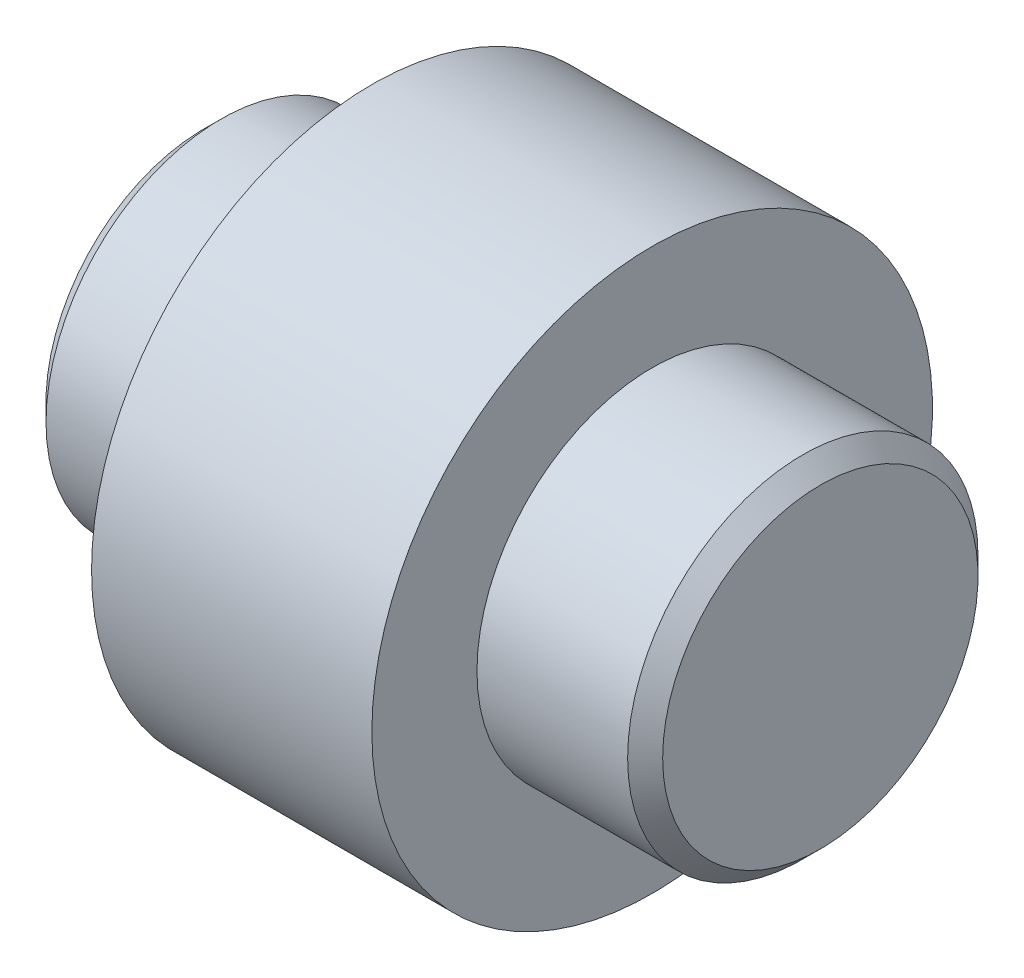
from build123d import *

# Parameters (mm, degrees)
CHANFREIN1_SIZE = 0.25


with BuildPart() as part:
    # Esquisse1 → R_volution1 (revolve)
    with BuildSketch(Plane.XY, mode=Mode.PRIVATE) as r_volution1_sk:
        Polygon((0, 0), (0, 2.5), (2.4, 2.5), (2.4, 4), (6.4, 4), (6.4, 2.5), (8.8, 2.5), (8.8, 0), align=None)
    revolve(r_volution1_sk.sketch.rotate(Axis((0, 0, 0), (1, 0, 0)), 90), axis=Axis((0, 0, 0), (1, 0, 0)))

    # Chanfrein1
    chanfrein1_edges = [part.edges().sort_by_distance(p)[0] for p in [
        (8.8, 0, -2.5),
        (0, 0, -2.5),
    ]]
    chamfer(chanfrein1_edges, length=CHANFREIN1_SIZE)


solid = part.part
